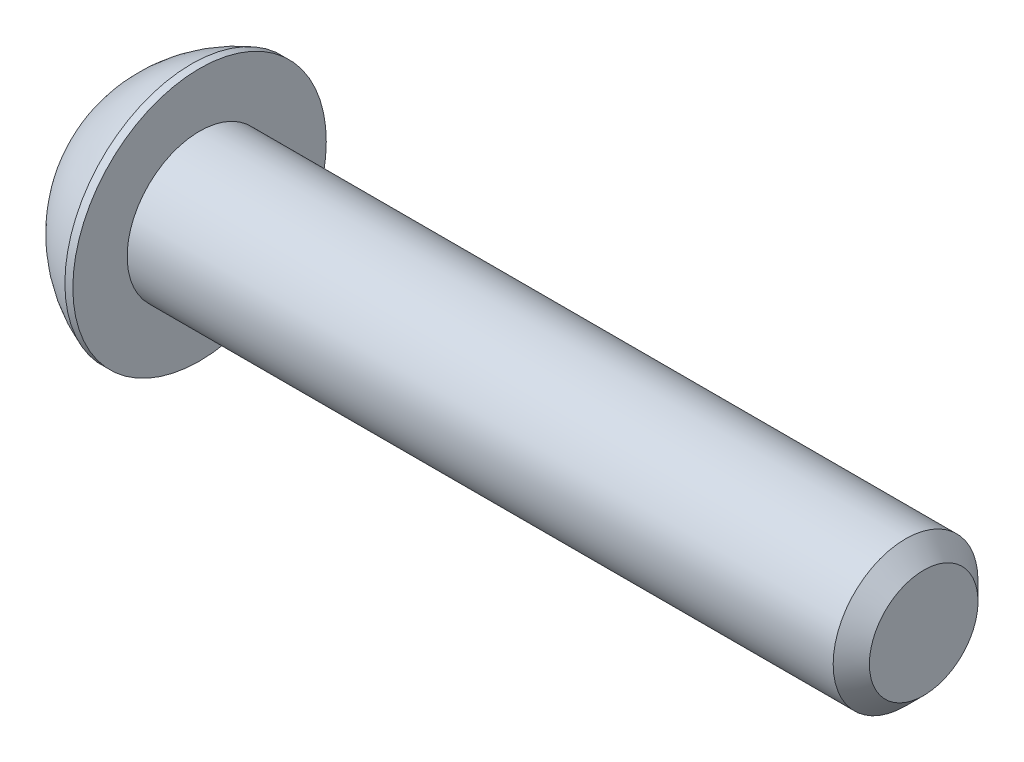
ISO-10303-21;
HEADER;
FILE_DESCRIPTION(('STEP AP214'),'2;1');
FILE_NAME('part.step','',(''),(''),'','','');
FILE_SCHEMA(('AUTOMOTIVE_DESIGN { 1 0 10303 214 1 1 1 1 }'));
ENDSEC;
DATA;
#1=APPLICATION_CONTEXT('core data for automotive mechanical design processes');
#2=APPLICATION_PROTOCOL_DEFINITION('international standard','automotive_design',2000,#1);
#3=PRODUCT_CONTEXT('',#1,'mechanical');
#4=PRODUCT('Part','Part','',(#3));
#5=PRODUCT_RELATED_PRODUCT_CATEGORY('part','',(#4));
#6=PRODUCT_DEFINITION_FORMATION('','',#4);
#7=PRODUCT_DEFINITION_CONTEXT('part definition',#1,'design');
#8=PRODUCT_DEFINITION('design','',#6,#7);
#9=PRODUCT_DEFINITION_SHAPE('','',#8);
#10=(LENGTH_UNIT() NAMED_UNIT(*) SI_UNIT(.MILLI.,.METRE.));
#11=(NAMED_UNIT(*) PLANE_ANGLE_UNIT() SI_UNIT($,.RADIAN.));
#12=(NAMED_UNIT(*) SI_UNIT($,.STERADIAN.) SOLID_ANGLE_UNIT());
#13=UNCERTAINTY_MEASURE_WITH_UNIT(LENGTH_MEASURE(1.E-05),#10,'distance_accuracy_value','');
#14=(GEOMETRIC_REPRESENTATION_CONTEXT(3) GLOBAL_UNCERTAINTY_ASSIGNED_CONTEXT((#13)) GLOBAL_UNIT_ASSIGNED_CONTEXT((#10,
#11,#12)) REPRESENTATION_CONTEXT('',''));
#15=CARTESIAN_POINT('',(0.,0.,0.));
#16=DIRECTION('',(0.,0.,1.));
#17=DIRECTION('',(1.,0.,0.));
#18=AXIS2_PLACEMENT_3D('',#15,#16,#17);
#19=CARTESIAN_POINT('',(40.,0.,0.));
#20=DIRECTION('',(1.,0.,0.));
#21=DIRECTION('',(0.,0.,-1.));
#22=AXIS2_PLACEMENT_3D('',#19,#20,#21);
#23=PLANE('',#22);
#24=CARTESIAN_POINT('',(39.9999999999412,0.,-3.4325117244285E-13));
#25=DIRECTION('',(-1.,0.,3.44552215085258E-13));
#26=DIRECTION('',(3.44552215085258E-13,0.,1.));
#27=AXIS2_PLACEMENT_3D('',#24,#25,#26);
#28=CIRCLE('',#27,2.99999999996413);
#29=CARTESIAN_POINT('',(39.9999999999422,0.,2.99999999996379));
#30=VERTEX_POINT('',#29);
#31=EDGE_CURVE('P0_E17',#30,#30,#28,.T.);
#32=ORIENTED_EDGE('',*,*,#31,.F.);
#33=EDGE_LOOP('',(#32));
#34=FACE_BOUND('',#33,.T.);
#35=ADVANCED_FACE('P0_F14',(#34),#23,.T.);
#36=CARTESIAN_POINT('',(0.,4.,0.));
#37=DIRECTION('',(1.,0.,0.));
#38=DIRECTION('',(0.,0.,-1.));
#39=AXIS2_PLACEMENT_3D('',#36,#37,#38);
#40=PLANE('',#39);
#41=CARTESIAN_POINT('',(0.,0.,0.));
#42=DIRECTION('',(1.,0.,0.));
#43=DIRECTION('',(0.,0.,-1.));
#44=AXIS2_PLACEMENT_3D('',#41,#42,#43);
#45=CIRCLE('',#44,4.);
#46=CARTESIAN_POINT('',(0.,0.,-4.));
#47=VERTEX_POINT('',#46);
#48=EDGE_CURVE('P0_E21',#47,#47,#45,.T.);
#49=ORIENTED_EDGE('',*,*,#48,.F.);
#50=EDGE_LOOP('',(#49));
#51=FACE_BOUND('',#50,.T.);
#52=ADVANCED_FACE('P0_F34',(#51),#40,.F.);
#53=CARTESIAN_POINT('',(39.000000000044,0.,0.));
#54=DIRECTION('',(-1.,0.,3.44552215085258E-13));
#55=DIRECTION('',(3.44552215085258E-13,0.,1.));
#56=AXIS2_PLACEMENT_3D('',#53,#54,#55);
#57=CONICAL_SURFACE('',#56,3.99999999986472,0.785398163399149);
#58=CARTESIAN_POINT('',(39.,0.,0.));
#59=DIRECTION('',(1.,0.,0.));
#60=DIRECTION('',(0.,0.,-1.));
#61=AXIS2_PLACEMENT_3D('',#58,#59,#60);
#62=CIRCLE('',#61,4.);
#63=CARTESIAN_POINT('',(39.,0.,-4.));
#64=VERTEX_POINT('',#63);
#65=EDGE_CURVE('P0_E10',#64,#64,#62,.F.);
#66=ORIENTED_EDGE('',*,*,#65,.F.);
#67=EDGE_LOOP('',(#66));
#68=FACE_BOUND('',#67,.T.);
#69=ORIENTED_EDGE('',*,*,#31,.T.);
#70=EDGE_LOOP('',(#69));
#71=FACE_BOUND('',#70,.T.);
#72=ADVANCED_FACE('P0_F31',(#68,#71),#57,.T.);
#73=CARTESIAN_POINT('',(20.,0.,0.));
#74=DIRECTION('',(1.,0.,0.));
#75=DIRECTION('',(0.,0.,-1.));
#76=AXIS2_PLACEMENT_3D('',#73,#74,#75);
#77=CYLINDRICAL_SURFACE('',#76,4.);
#78=ORIENTED_EDGE('',*,*,#48,.T.);
#79=EDGE_LOOP('',(#78));
#80=FACE_BOUND('',#79,.T.);
#81=ORIENTED_EDGE('',*,*,#65,.T.);
#82=EDGE_LOOP('',(#81));
#83=FACE_BOUND('',#82,.T.);
#84=ADVANCED_FACE('P0_F40',(#80,#83),#77,.T.);
#85=CLOSED_SHELL('',(#35,#52,#72,#84));
#86=MANIFOLD_SOLID_BREP('P0_B1',#85);
#87=CARTESIAN_POINT('',(-1.8,0.,0.));
#88=DIRECTION('',(1.,0.,0.));
#89=DIRECTION('',(0.,0.,-1.));
#90=AXIS2_PLACEMENT_3D('',#87,#88,#89);
#91=PLANE('',#90);
#92=DIRECTION('',(0.,-1.,0.));
#93=VECTOR('',#92,1.);
#94=CARTESIAN_POINT('',(-1.80000000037,0.,2.5));
#95=LINE('',#94,#93);
#96=CARTESIAN_POINT('',(-1.8000000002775,-1.44337567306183,2.49999999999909));
#97=VERTEX_POINT('',#96);
#98=CARTESIAN_POINT('',(-1.800000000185,1.44337567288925,2.50000000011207));
#99=VERTEX_POINT('',#98);
#100=EDGE_CURVE('P1_E102',#97,#99,#95,.F.);
#101=ORIENTED_EDGE('',*,*,#100,.T.);
#102=DIRECTION('',(0.,-0.50000000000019,0.866025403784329));
#103=VECTOR('',#102,1.);
#104=CARTESIAN_POINT('',(-1.80000000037,2.16506350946,1.25));
#105=LINE('',#104,#103);
#106=CARTESIAN_POINT('',(-1.800000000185,2.88675134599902,1.29572266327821E-10));
#107=VERTEX_POINT('',#106);
#108=EDGE_CURVE('P1_E97',#99,#107,#105,.F.);
#109=ORIENTED_EDGE('',*,*,#108,.T.);
#110=DIRECTION('',(0.,0.50000000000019,0.866025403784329));
#111=VECTOR('',#110,1.);
#112=CARTESIAN_POINT('',(-1.80000000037,2.16506350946,-1.25));
#113=LINE('',#112,#111);
#114=CARTESIAN_POINT('',(-1.800000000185,1.44337567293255,-2.50000000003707));
#115=VERTEX_POINT('',#114);
#116=EDGE_CURVE('P1_E93',#107,#115,#113,.F.);
#117=ORIENTED_EDGE('',*,*,#116,.T.);
#118=DIRECTION('',(0.,1.,0.));
#119=VECTOR('',#118,1.);
#120=CARTESIAN_POINT('',(-1.80000000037,0.,-2.5));
#121=LINE('',#120,#119);
#122=CARTESIAN_POINT('',(-1.800000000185,-1.44337567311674,-2.4999999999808));
#123=VERTEX_POINT('',#122);
#124=EDGE_CURVE('P1_E66',#115,#123,#121,.F.);
#125=ORIENTED_EDGE('',*,*,#124,.T.);
#126=DIRECTION('',(0.,0.50000000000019,-0.866025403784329));
#127=VECTOR('',#126,1.);
#128=CARTESIAN_POINT('',(-1.80000000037,-2.16506350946,-1.25));
#129=LINE('',#128,#127);
#130=CARTESIAN_POINT('',(-1.800000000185,-2.88675134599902,-1.29572861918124E-10));
#131=VERTEX_POINT('',#130);
#132=EDGE_CURVE('P1_E68',#123,#131,#129,.F.);
#133=ORIENTED_EDGE('',*,*,#132,.T.);
#134=DIRECTION('',(0.,-0.50000000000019,-0.866025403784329));
#135=VECTOR('',#134,1.);
#136=CARTESIAN_POINT('',(-1.80000000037,-2.16506350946,1.25));
#137=LINE('',#136,#135);
#138=EDGE_CURVE('P1_E70',#131,#97,#137,.F.);
#139=ORIENTED_EDGE('',*,*,#138,.T.);
#140=EDGE_LOOP('',(#101,#109,#117,#125,#133,#139));
#141=FACE_BOUND('',#140,.T.);
#142=ADVANCED_FACE('P1_F16',(#141),#91,.F.);
#143=CARTESIAN_POINT('',(-5.4,-2.16506350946,1.25));
#144=DIRECTION('',(0.,-0.866025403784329,0.50000000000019));
#145=DIRECTION('',(0.,-0.50000000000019,-0.866025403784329));
#146=AXIS2_PLACEMENT_3D('',#143,#144,#145);
#147=PLANE('',#146);
#148=DIRECTION('',(1.,0.,0.));
#149=VECTOR('',#148,1.);
#150=CARTESIAN_POINT('',(-5.4,-1.44337567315,2.5));
#151=LINE('',#150,#149);
#152=CARTESIAN_POINT('',(-4.4,-1.44337567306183,2.49999999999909));
#153=VERTEX_POINT('',#152);
#154=EDGE_CURVE('P1_E81',#153,#97,#151,.T.);
#155=ORIENTED_EDGE('',*,*,#154,.T.);
#156=ORIENTED_EDGE('',*,*,#138,.F.);
#157=DIRECTION('',(1.,0.,0.));
#158=VECTOR('',#157,1.);
#159=CARTESIAN_POINT('',(-5.4,-2.88675134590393,-7.52941545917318E-11));
#160=LINE('',#159,#158);
#161=CARTESIAN_POINT('',(-4.4,-2.88675134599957,-1.292594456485E-10));
#162=VERTEX_POINT('',#161);
#163=EDGE_CURVE('P1_E75',#131,#162,#160,.F.);
#164=ORIENTED_EDGE('',*,*,#163,.T.);
#165=DIRECTION('',(0.,-0.499999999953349,-0.866025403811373));
#166=VECTOR('',#165,1.);
#167=CARTESIAN_POINT('',(-4.4,-1.44337567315,2.5));
#168=LINE('',#167,#166);
#169=EDGE_CURVE('P1_E105',#153,#162,#168,.T.);
#170=ORIENTED_EDGE('',*,*,#169,.F.);
#171=EDGE_LOOP('',(#155,#156,#164,#170));
#172=FACE_BOUND('',#171,.T.);
#173=ADVANCED_FACE('P1_F78',(#172),#147,.F.);
#174=CARTESIAN_POINT('',(-5.4,-2.16506350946,-1.25));
#175=DIRECTION('',(0.,-0.866025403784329,-0.50000000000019));
#176=DIRECTION('',(0.,0.50000000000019,-0.866025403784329));
#177=AXIS2_PLACEMENT_3D('',#174,#175,#176);
#178=PLANE('',#177);
#179=ORIENTED_EDGE('',*,*,#163,.F.);
#180=ORIENTED_EDGE('',*,*,#132,.F.);
#181=DIRECTION('',(-1.,0.,0.));
#182=VECTOR('',#181,1.);
#183=CARTESIAN_POINT('',(-5.4,-1.44337567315,-2.5));
#184=LINE('',#183,#182);
#185=CARTESIAN_POINT('',(-4.4,-1.44337567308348,-2.49999999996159));
#186=VERTEX_POINT('',#185);
#187=EDGE_CURVE('P1_E89',#123,#186,#184,.T.);
#188=ORIENTED_EDGE('',*,*,#187,.T.);
#189=DIRECTION('',(0.,0.499999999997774,-0.866025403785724));
#190=VECTOR('',#189,1.);
#191=CARTESIAN_POINT('',(-4.4,-2.88675134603,-1.48083101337E-10));
#192=LINE('',#191,#190);
#193=EDGE_CURVE('P1_E86',#162,#186,#192,.T.);
#194=ORIENTED_EDGE('',*,*,#193,.F.);
#195=EDGE_LOOP('',(#179,#180,#188,#194));
#196=FACE_BOUND('',#195,.T.);
#197=ADVANCED_FACE('P1_F84',(#196),#178,.F.);
#198=CARTESIAN_POINT('',(-5.4,0.,-2.5));
#199=DIRECTION('',(0.,0.,-1.));
#200=DIRECTION('',(-1.,0.,0.));
#201=AXIS2_PLACEMENT_3D('',#198,#199,#200);
#202=PLANE('',#201);
#203=ORIENTED_EDGE('',*,*,#187,.F.);
#204=ORIENTED_EDGE('',*,*,#124,.F.);
#205=DIRECTION('',(1.,0.,0.));
#206=VECTOR('',#205,1.);
#207=CARTESIAN_POINT('',(-5.4,1.443375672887,-2.50000000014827));
#208=LINE('',#207,#206);
#209=CARTESIAN_POINT('',(-4.4,1.4433756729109,-2.50000000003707));
#210=VERTEX_POINT('',#209);
#211=EDGE_CURVE('P1_E95',#115,#210,#208,.F.);
#212=ORIENTED_EDGE('',*,*,#211,.T.);
#213=DIRECTION('',(0.,-1.,0.));
#214=VECTOR('',#213,1.);
#215=CARTESIAN_POINT('',(-4.4,1.925,-2.5));
#216=LINE('',#215,#214);
#217=EDGE_CURVE('P1_E108',#186,#210,#216,.F.);
#218=ORIENTED_EDGE('',*,*,#217,.F.);
#219=EDGE_LOOP('',(#203,#204,#212,#218));
#220=FACE_BOUND('',#219,.T.);
#221=ADVANCED_FACE('P1_F193',(#220),#202,.F.);
#222=CARTESIAN_POINT('',(-5.4,2.16506350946,-1.25));
#223=DIRECTION('',(0.,0.866025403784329,-0.50000000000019));
#224=DIRECTION('',(0.,0.50000000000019,0.866025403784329));
#225=AXIS2_PLACEMENT_3D('',#222,#223,#224);
#226=PLANE('',#225);
#227=ORIENTED_EDGE('',*,*,#211,.F.);
#228=ORIENTED_EDGE('',*,*,#116,.F.);
#229=DIRECTION('',(1.,0.,0.));
#230=VECTOR('',#229,1.);
#231=CARTESIAN_POINT('',(-5.4,2.88675134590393,7.52939377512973E-11));
#232=LINE('',#231,#230);
#233=CARTESIAN_POINT('',(-4.4,2.88675134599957,1.29259136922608E-10));
#234=VERTEX_POINT('',#233);
#235=EDGE_CURVE('P1_E99',#107,#234,#232,.F.);
#236=ORIENTED_EDGE('',*,*,#235,.T.);
#237=DIRECTION('',(0.,0.499999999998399,0.866025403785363));
#238=VECTOR('',#237,1.);
#239=CARTESIAN_POINT('',(-4.4,1.44337567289,-2.50000000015));
#240=LINE('',#239,#238);
#241=EDGE_CURVE('P1_E111',#210,#234,#240,.T.);
#242=ORIENTED_EDGE('',*,*,#241,.F.);
#243=EDGE_LOOP('',(#227,#228,#236,#242));
#244=FACE_BOUND('',#243,.T.);
#245=ADVANCED_FACE('P1_F184',(#244),#226,.F.);
#246=CARTESIAN_POINT('',(-5.4,2.16506350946,1.25));
#247=DIRECTION('',(0.,0.866025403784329,0.50000000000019));
#248=DIRECTION('',(0.,-0.50000000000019,0.866025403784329));
#249=AXIS2_PLACEMENT_3D('',#246,#247,#248);
#250=PLANE('',#249);
#251=ORIENTED_EDGE('',*,*,#235,.F.);
#252=ORIENTED_EDGE('',*,*,#108,.F.);
#253=DIRECTION('',(1.,0.,0.));
#254=VECTOR('',#253,1.);
#255=CARTESIAN_POINT('',(-5.4,1.44337567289,2.5));
#256=LINE('',#255,#254);
#257=CARTESIAN_POINT('',(-4.4,1.4433756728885,2.50000000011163));
#258=VERTEX_POINT('',#257);
#259=EDGE_CURVE('P1_E33',#99,#258,#256,.F.);
#260=ORIENTED_EDGE('',*,*,#259,.T.);
#261=DIRECTION('',(0.,-0.500000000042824,0.866025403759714));
#262=VECTOR('',#261,1.);
#263=CARTESIAN_POINT('',(-4.4,2.88675134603,1.48082879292E-10));
#264=LINE('',#263,#262);
#265=EDGE_CURVE('P1_E114',#234,#258,#264,.T.);
#266=ORIENTED_EDGE('',*,*,#265,.F.);
#267=EDGE_LOOP('',(#251,#252,#260,#266));
#268=FACE_BOUND('',#267,.T.);
#269=ADVANCED_FACE('P1_F141',(#268),#250,.F.);
#270=CARTESIAN_POINT('',(-5.4,0.,2.5));
#271=DIRECTION('',(0.,0.,1.));
#272=DIRECTION('',(0.,-1.,0.));
#273=AXIS2_PLACEMENT_3D('',#270,#271,#272);
#274=PLANE('',#273);
#275=ORIENTED_EDGE('',*,*,#259,.F.);
#276=ORIENTED_EDGE('',*,*,#100,.F.);
#277=ORIENTED_EDGE('',*,*,#154,.F.);
#278=DIRECTION('',(0.,-1.,0.));
#279=VECTOR('',#278,1.);
#280=CARTESIAN_POINT('',(-4.4,1.925,2.50000000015));
#281=LINE('',#280,#279);
#282=EDGE_CURVE('P1_E117',#258,#153,#281,.T.);
#283=ORIENTED_EDGE('',*,*,#282,.F.);
#284=EDGE_LOOP('',(#275,#276,#277,#283));
#285=FACE_BOUND('',#284,.T.);
#286=ADVANCED_FACE('P1_F130',(#285),#274,.F.);
#287=CARTESIAN_POINT('',(-4.4,1.925,0.));
#288=DIRECTION('',(-1.,0.,0.));
#289=DIRECTION('',(0.,-1.,0.));
#290=AXIS2_PLACEMENT_3D('',#287,#288,#289);
#291=PLANE('',#290);
#292=ORIENTED_EDGE('',*,*,#265,.T.);
#293=ORIENTED_EDGE('',*,*,#282,.T.);
#294=ORIENTED_EDGE('',*,*,#169,.T.);
#295=ORIENTED_EDGE('',*,*,#193,.T.);
#296=ORIENTED_EDGE('',*,*,#217,.T.);
#297=ORIENTED_EDGE('',*,*,#241,.T.);
#298=EDGE_LOOP('',(#292,#293,#294,#295,#296,#297));
#299=FACE_BOUND('',#298,.T.);
#300=CARTESIAN_POINT('',(-4.39999999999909,0.,0.));
#301=DIRECTION('',(1.,0.,0.));
#302=DIRECTION('',(0.,0.,-1.));
#303=AXIS2_PLACEMENT_3D('',#300,#301,#302);
#304=CIRCLE('',#303,3.84999999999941);
#305=CARTESIAN_POINT('',(-4.39999999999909,0.,-3.84999999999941));
#306=VERTEX_POINT('',#305);
#307=EDGE_CURVE('P1_E19',#306,#306,#304,.T.);
#308=ORIENTED_EDGE('',*,*,#307,.F.);
#309=EDGE_LOOP('',(#308));
#310=FACE_BOUND('',#309,.T.);
#311=ADVANCED_FACE('P1_F128',(#299,#310),#291,.T.);
#312=CARTESIAN_POINT('',(2.27175799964,0.,0.));
#313=DIRECTION('',(1.,0.,0.));
#314=DIRECTION('',(0.,0.,1.));
#315=AXIS2_PLACEMENT_3D('',#312,#313,#314);
#316=DEGENERATE_TOROIDAL_SURFACE('',#315,0.473210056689,7.95,.F.);
#317=CARTESIAN_POINT('',(-0.440000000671,0.,0.));
#318=DIRECTION('',(1.,0.,0.));
#319=DIRECTION('',(0.,0.,-1.));
#320=AXIS2_PLACEMENT_3D('',#317,#318,#319);
#321=CIRCLE('',#320,7.);
#322=CARTESIAN_POINT('',(-0.440000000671,0.,-7.));
#323=VERTEX_POINT('',#322);
#324=EDGE_CURVE('P1_E25',#323,#323,#321,.T.);
#325=ORIENTED_EDGE('',*,*,#324,.F.);
#326=EDGE_LOOP('',(#325));
#327=FACE_BOUND('',#326,.T.);
#328=ORIENTED_EDGE('',*,*,#307,.T.);
#329=EDGE_LOOP('',(#328));
#330=FACE_BOUND('',#329,.T.);
#331=ADVANCED_FACE('P1_F126',(#327,#330),#316,.F.);
#332=CARTESIAN_POINT('',(-0.22,0.,0.));
#333=DIRECTION('',(1.,0.,0.));
#334=DIRECTION('',(0.,0.,-1.));
#335=AXIS2_PLACEMENT_3D('',#332,#333,#334);
#336=CYLINDRICAL_SURFACE('',#335,7.);
#337=ORIENTED_EDGE('',*,*,#324,.T.);
#338=EDGE_LOOP('',(#337));
#339=FACE_BOUND('',#338,.T.);
#340=CARTESIAN_POINT('',(6.70551261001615E-10,0.,0.));
#341=DIRECTION('',(1.,0.,0.));
#342=DIRECTION('',(0.,0.,-1.));
#343=AXIS2_PLACEMENT_3D('',#340,#341,#342);
#344=CIRCLE('',#343,7.);
#345=CARTESIAN_POINT('',(6.70551261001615E-10,0.,-7.));
#346=VERTEX_POINT('',#345);
#347=EDGE_CURVE('P1_E11',#346,#346,#344,.T.);
#348=ORIENTED_EDGE('',*,*,#347,.F.);
#349=EDGE_LOOP('',(#348));
#350=FACE_BOUND('',#349,.T.);
#351=ADVANCED_FACE('P1_F138',(#339,#350),#336,.T.);
#352=CARTESIAN_POINT('',(0.,5.7,0.));
#353=DIRECTION('',(1.,0.,0.));
#354=DIRECTION('',(0.,0.,-1.));
#355=AXIS2_PLACEMENT_3D('',#352,#353,#354);
#356=PLANE('',#355);
#357=ORIENTED_EDGE('',*,*,#347,.T.);
#358=EDGE_LOOP('',(#357));
#359=FACE_BOUND('',#358,.T.);
#360=ADVANCED_FACE('P1_F144',(#359),#356,.T.);
#361=CLOSED_SHELL('',(#142,#173,#197,#221,#245,#269,#286,#311,#331,#351,#360));
#362=MANIFOLD_SOLID_BREP('P1_B1',#361);
#363=ADVANCED_BREP_SHAPE_REPRESENTATION('',(#18,#86,#362),#14);
#364=SHAPE_DEFINITION_REPRESENTATION(#9,#363);
ENDSEC;
END-ISO-10303-21;
